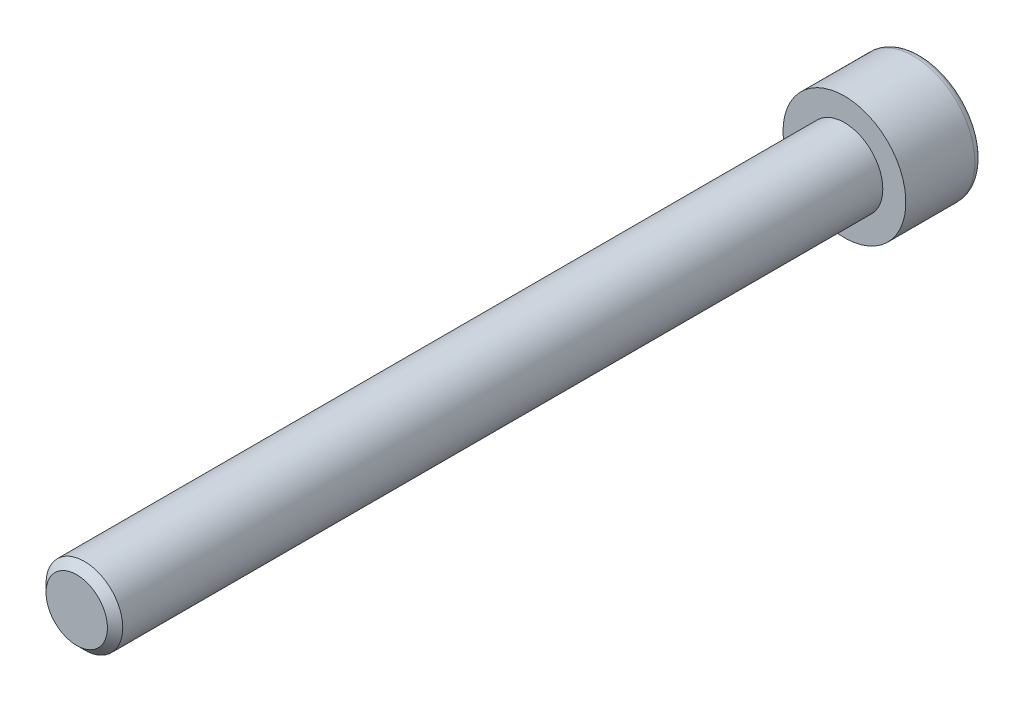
from build123d import *

# Parameters (mm, degrees)
ENLEV_MAT_EXTRU1_DEPTH = 5
ESQUISSE3_W            = 5
ESQUISSE3_H            = 100
CHANFREIN1_SIZE        = 1


with BuildPart() as part:
    # Esquisse1 → Base-R_volution (revolve)
    with BuildSketch(Plane(origin=(0, 0, 0), x_dir=(1, 0, 0), z_dir=(0, 1, 0)), mode=Mode.PRIVATE) as base_r_volution_sk:
        with BuildLine():
            Line((0, 0), (8, 0))
            Line((8, 0), (8, 9))
            ThreePointArc((8, 9), (7.707106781, 9.707106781), (7, 10))
            Line((7, 10), (0, 10))
            Line((0, 10), (0, 0))
        make_face()
    revolve(base_r_volution_sk.sketch.rotate(Axis((0, 0, 0), (0, 0, -1)), 180), axis=Axis((0, 0, 0), (0, 0, -1)))

    # Esquisse2 → enlev-mat-Extru1 (cut)
    with BuildSketch(Plane.XY.offset(-10)):
        Polygon((4, -2.309401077), (4, 2.309401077), (0, 4.618802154), (-4, 2.309401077), (-4, -2.309401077), (0, -4.618802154), align=None)
    extrude(amount=ENLEV_MAT_EXTRU1_DEPTH, mode=Mode.SUBTRACT)

    # Esquisse3 → Boss.-R_vol.1 (revolve)
    with BuildSketch(Plane(origin=(0, 0, 0), x_dir=(1, 0, 0), z_dir=(0, 1, 0))):
        with Locations((2.5, -50)):
            Rectangle(ESQUISSE3_W, ESQUISSE3_H)
    revolve(axis=Axis((0, 0, 0), (0, 0, 1)))

    # Chanfrein1
    chanfrein1_edges = [part.edges().sort_by_distance(p)[0] for p in [
        (-5, 0, 100),
    ]]
    chamfer(chanfrein1_edges, length=CHANFREIN1_SIZE)


solid = part.part
